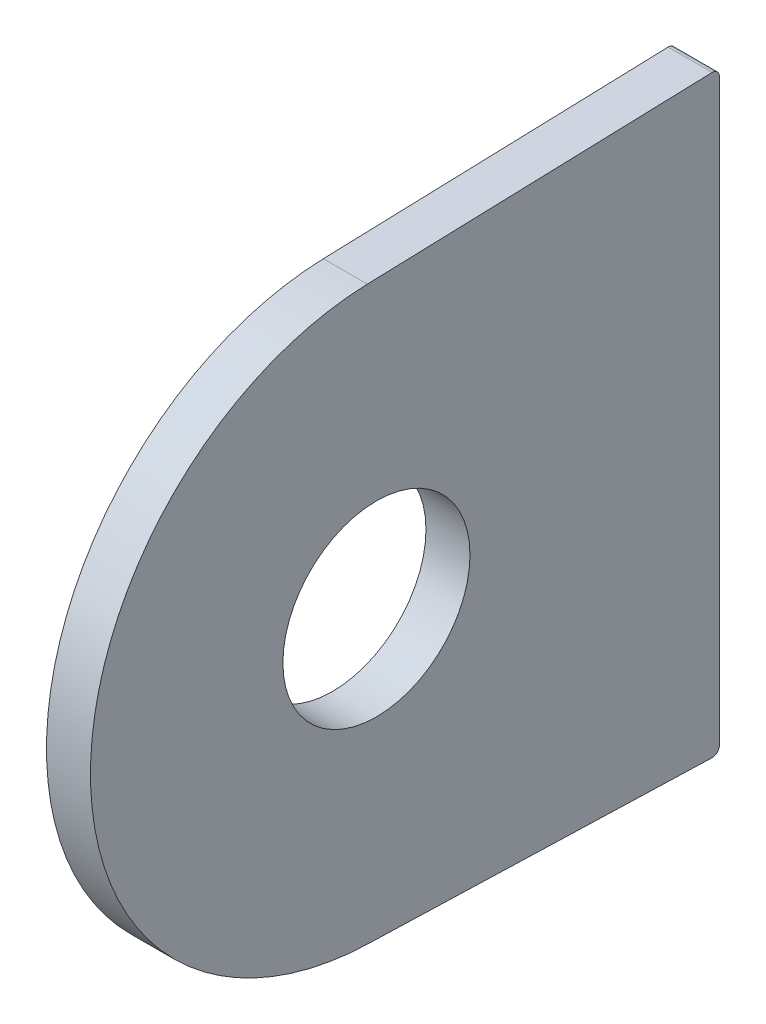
ISO-10303-21;
HEADER;
FILE_DESCRIPTION(('STEP AP214'),'2;1');
FILE_NAME('part.step','',(''),(''),'','','');
FILE_SCHEMA(('AUTOMOTIVE_DESIGN { 1 0 10303 214 1 1 1 1 }'));
ENDSEC;
DATA;
#1=APPLICATION_CONTEXT('core data for automotive mechanical design processes');
#2=APPLICATION_PROTOCOL_DEFINITION('international standard','automotive_design',2000,#1);
#3=PRODUCT_CONTEXT('',#1,'mechanical');
#4=PRODUCT('Part','Part','',(#3));
#5=PRODUCT_RELATED_PRODUCT_CATEGORY('part','',(#4));
#6=PRODUCT_DEFINITION_FORMATION('','',#4);
#7=PRODUCT_DEFINITION_CONTEXT('part definition',#1,'design');
#8=PRODUCT_DEFINITION('design','',#6,#7);
#9=PRODUCT_DEFINITION_SHAPE('','',#8);
#10=(LENGTH_UNIT() NAMED_UNIT(*) SI_UNIT(.MILLI.,.METRE.));
#11=(NAMED_UNIT(*) PLANE_ANGLE_UNIT() SI_UNIT($,.RADIAN.));
#12=(NAMED_UNIT(*) SI_UNIT($,.STERADIAN.) SOLID_ANGLE_UNIT());
#13=UNCERTAINTY_MEASURE_WITH_UNIT(LENGTH_MEASURE(1.E-05),#10,'distance_accuracy_value','');
#14=(GEOMETRIC_REPRESENTATION_CONTEXT(3) GLOBAL_UNCERTAINTY_ASSIGNED_CONTEXT((#13)) GLOBAL_UNIT_ASSIGNED_CONTEXT((#10,
#11,#12)) REPRESENTATION_CONTEXT('',''));
#15=CARTESIAN_POINT('',(0.,0.,0.));
#16=DIRECTION('',(0.,0.,1.));
#17=DIRECTION('',(1.,0.,0.));
#18=AXIS2_PLACEMENT_3D('',#15,#16,#17);
#19=CARTESIAN_POINT('',(1.5875,-20.627166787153,0.652990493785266));
#20=DIRECTION('',(0.,-0.999499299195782,0.0316409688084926));
#21=DIRECTION('',(0.,-0.0316409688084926,-0.999499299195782));
#22=AXIS2_PLACEMENT_3D('',#19,#20,#21);
#23=PLANE('',#22);
#24=DIRECTION('',(0.,0.0316409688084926,0.999499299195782));
#25=VECTOR('',#24,1.);
#26=CARTESIAN_POINT('',(-1.5875,-20.627166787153,0.652990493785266));
#27=LINE('',#26,#25);
#28=CARTESIAN_POINT('',(-1.5875,-21.4146594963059,-24.22293589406));
#29=VERTEX_POINT('',#28);
#30=CARTESIAN_POINT('',(-1.5875,-20.627166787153,0.652990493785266));
#31=VERTEX_POINT('',#30);
#32=EDGE_CURVE('E125',#29,#31,#27,.T.);
#33=ORIENTED_EDGE('',*,*,#32,.F.);
#34=DIRECTION('',(-1.,0.,0.));
#35=VECTOR('',#34,1.);
#36=CARTESIAN_POINT('',(1.5875,-21.4146594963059,-24.22293589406));
#37=LINE('',#36,#35);
#38=CARTESIAN_POINT('',(1.5875,-21.4146594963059,-24.22293589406));
#39=VERTEX_POINT('',#38);
#40=EDGE_CURVE('E138',#29,#39,#37,.F.);
#41=ORIENTED_EDGE('',*,*,#40,.T.);
#42=DIRECTION('',(0.,0.0316409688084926,0.999499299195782));
#43=VECTOR('',#42,1.);
#44=CARTESIAN_POINT('',(1.5875,-20.627166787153,0.652990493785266));
#45=LINE('',#44,#43);
#46=CARTESIAN_POINT('',(1.5875,-20.627166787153,0.652990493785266));
#47=VERTEX_POINT('',#46);
#48=EDGE_CURVE('E132',#39,#47,#45,.T.);
#49=ORIENTED_EDGE('',*,*,#48,.T.);
#50=DIRECTION('',(-1.,0.,0.));
#51=VECTOR('',#50,1.);
#52=CARTESIAN_POINT('',(1.5875,-20.627166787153,0.652990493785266));
#53=LINE('',#52,#51);
#54=EDGE_CURVE('E117',#47,#31,#53,.T.);
#55=ORIENTED_EDGE('',*,*,#54,.T.);
#56=EDGE_LOOP('',(#33,#41,#49,#55));
#57=FACE_BOUND('',#56,.T.);
#58=ADVANCED_FACE('F43',(#57),#23,.T.);
#59=CARTESIAN_POINT('',(1.5875,0.,-24.7470095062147));
#60=DIRECTION('',(0.,0.,1.));
#61=DIRECTION('',(1.,0.,0.));
#62=AXIS2_PLACEMENT_3D('',#59,#60,#61);
#63=PLANE('',#62);
#64=DIRECTION('',(0.,1.,0.));
#65=VECTOR('',#64,1.);
#66=CARTESIAN_POINT('',(-1.5875,0.,-24.7470095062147));
#67=LINE('',#66,#65);
#68=CARTESIAN_POINT('',(-1.5875,-20.9069138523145,-24.7470095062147));
#69=VERTEX_POINT('',#68);
#70=CARTESIAN_POINT('',(-1.5875,20.9069138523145,-24.7470095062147));
#71=VERTEX_POINT('',#70);
#72=EDGE_CURVE('E127',#69,#71,#67,.T.);
#73=ORIENTED_EDGE('',*,*,#72,.T.);
#74=DIRECTION('',(-1.,0.,0.));
#75=VECTOR('',#74,1.);
#76=CARTESIAN_POINT('',(1.5875,20.9069138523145,-24.7470095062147));
#77=LINE('',#76,#75);
#78=CARTESIAN_POINT('',(1.5875,20.9069138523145,-24.7470095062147));
#79=VERTEX_POINT('',#78);
#80=EDGE_CURVE('E51',#71,#79,#77,.F.);
#81=ORIENTED_EDGE('',*,*,#80,.T.);
#82=DIRECTION('',(0.,1.,0.));
#83=VECTOR('',#82,1.);
#84=CARTESIAN_POINT('',(1.5875,0.,-24.7470095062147));
#85=LINE('',#84,#83);
#86=CARTESIAN_POINT('',(1.5875,-20.9069138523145,-24.7470095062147));
#87=VERTEX_POINT('',#86);
#88=EDGE_CURVE('E107',#87,#79,#85,.T.);
#89=ORIENTED_EDGE('',*,*,#88,.F.);
#90=DIRECTION('',(-1.,0.,0.));
#91=VECTOR('',#90,1.);
#92=CARTESIAN_POINT('',(-1.5875,-20.9069138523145,-24.7470095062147));
#93=LINE('',#92,#91);
#94=EDGE_CURVE('E116',#87,#69,#93,.T.);
#95=ORIENTED_EDGE('',*,*,#94,.T.);
#96=EDGE_LOOP('',(#73,#81,#89,#95));
#97=FACE_BOUND('',#96,.T.);
#98=ADVANCED_FACE('F173',(#97),#63,.F.);
#99=CARTESIAN_POINT('',(1.5875,20.627166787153,0.652990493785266));
#100=DIRECTION('',(0.,-0.999499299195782,-0.0316409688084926));
#101=DIRECTION('',(0.,0.0316409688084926,-0.999499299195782));
#102=AXIS2_PLACEMENT_3D('',#99,#100,#101);
#103=PLANE('',#102);
#104=DIRECTION('',(0.,-0.0316409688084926,0.999499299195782));
#105=VECTOR('',#104,1.);
#106=CARTESIAN_POINT('',(1.5875,20.627166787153,0.652990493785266));
#107=LINE('',#106,#105);
#108=CARTESIAN_POINT('',(1.5875,21.4146594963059,-24.22293589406));
#109=VERTEX_POINT('',#108);
#110=CARTESIAN_POINT('',(1.5875,20.627166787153,0.652990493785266));
#111=VERTEX_POINT('',#110);
#112=EDGE_CURVE('E96',#109,#111,#107,.T.);
#113=ORIENTED_EDGE('',*,*,#112,.F.);
#114=DIRECTION('',(-1.,0.,0.));
#115=VECTOR('',#114,1.);
#116=CARTESIAN_POINT('',(1.5875,21.4146594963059,-24.22293589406));
#117=LINE('',#116,#115);
#118=CARTESIAN_POINT('',(-1.5875,21.4146594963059,-24.22293589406));
#119=VERTEX_POINT('',#118);
#120=EDGE_CURVE('E142',#109,#119,#117,.T.);
#121=ORIENTED_EDGE('',*,*,#120,.T.);
#122=DIRECTION('',(0.,-0.0316409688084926,0.999499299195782));
#123=VECTOR('',#122,1.);
#124=CARTESIAN_POINT('',(-1.5875,20.627166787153,0.652990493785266));
#125=LINE('',#124,#123);
#126=CARTESIAN_POINT('',(-1.5875,20.627166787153,0.652990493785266));
#127=VERTEX_POINT('',#126);
#128=EDGE_CURVE('E112',#119,#127,#125,.T.);
#129=ORIENTED_EDGE('',*,*,#128,.T.);
#130=DIRECTION('',(-1.,0.,0.));
#131=VECTOR('',#130,1.);
#132=CARTESIAN_POINT('',(1.5875,20.627166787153,0.652990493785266));
#133=LINE('',#132,#131);
#134=EDGE_CURVE('E110',#111,#127,#133,.T.);
#135=ORIENTED_EDGE('',*,*,#134,.F.);
#136=EDGE_LOOP('',(#113,#121,#129,#135));
#137=FACE_BOUND('',#136,.T.);
#138=ADVANCED_FACE('F111',(#137),#103,.F.);
#139=CARTESIAN_POINT('',(1.5875,0.,0.));
#140=DIRECTION('',(-1.,0.,0.));
#141=DIRECTION('',(0.,0.,1.));
#142=AXIS2_PLACEMENT_3D('',#139,#140,#141);
#143=CYLINDRICAL_SURFACE('',#142,20.6375);
#144=CARTESIAN_POINT('',(-1.5875,0.,0.));
#145=DIRECTION('',(1.,0.,0.));
#146=DIRECTION('',(0.,0.,-1.));
#147=AXIS2_PLACEMENT_3D('',#144,#145,#146);
#148=CIRCLE('',#147,20.6375);
#149=EDGE_CURVE('E131',#127,#31,#148,.T.);
#150=ORIENTED_EDGE('',*,*,#149,.T.);
#151=ORIENTED_EDGE('',*,*,#54,.F.);
#152=CARTESIAN_POINT('',(1.5875,0.,0.));
#153=DIRECTION('',(1.,0.,0.));
#154=DIRECTION('',(0.,0.,-1.));
#155=AXIS2_PLACEMENT_3D('',#152,#153,#154);
#156=CIRCLE('',#155,20.6375);
#157=EDGE_CURVE('E101',#111,#47,#156,.T.);
#158=ORIENTED_EDGE('',*,*,#157,.F.);
#159=ORIENTED_EDGE('',*,*,#134,.T.);
#160=EDGE_LOOP('',(#150,#151,#158,#159));
#161=FACE_BOUND('',#160,.T.);
#162=ADVANCED_FACE('F119',(#161),#143,.T.);
#163=CARTESIAN_POINT('',(1.5875,0.,0.));
#164=DIRECTION('',(1.,0.,0.));
#165=DIRECTION('',(0.,0.,-1.));
#166=AXIS2_PLACEMENT_3D('',#163,#164,#165);
#167=PLANE('',#166);
#168=CARTESIAN_POINT('',(1.5875,0.,0.));
#169=DIRECTION('',(-1.,0.,0.));
#170=DIRECTION('',(0.,0.,1.));
#171=AXIS2_PLACEMENT_3D('',#168,#169,#170);
#172=CIRCLE('',#171,6.75);
#173=CARTESIAN_POINT('',(1.5875,0.,6.75));
#174=VERTEX_POINT('',#173);
#175=EDGE_CURVE('E128',#174,#174,#172,.T.);
#176=ORIENTED_EDGE('',*,*,#175,.T.);
#177=EDGE_LOOP('',(#176));
#178=FACE_BOUND('',#177,.T.);
#179=ORIENTED_EDGE('',*,*,#88,.T.);
#180=CARTESIAN_POINT('',(1.5875,20.9069138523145,-24.2390095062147));
#181=DIRECTION('',(1.,0.,0.));
#182=DIRECTION('',(0.,0.,-1.));
#183=AXIS2_PLACEMENT_3D('',#180,#181,#182);
#184=CIRCLE('',#183,0.508);
#185=EDGE_CURVE('E11',#79,#109,#184,.T.);
#186=ORIENTED_EDGE('',*,*,#185,.T.);
#187=ORIENTED_EDGE('',*,*,#112,.T.);
#188=ORIENTED_EDGE('',*,*,#157,.T.);
#189=ORIENTED_EDGE('',*,*,#48,.F.);
#190=CARTESIAN_POINT('',(1.5875,-20.9069138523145,-24.2390095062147));
#191=DIRECTION('',(1.,0.,0.));
#192=DIRECTION('',(0.,0.,-1.));
#193=AXIS2_PLACEMENT_3D('',#190,#191,#192);
#194=CIRCLE('',#193,0.508);
#195=EDGE_CURVE('E140',#39,#87,#194,.T.);
#196=ORIENTED_EDGE('',*,*,#195,.T.);
#197=EDGE_LOOP('',(#179,#186,#187,#188,#189,#196));
#198=FACE_BOUND('',#197,.T.);
#199=ADVANCED_FACE('F98',(#178,#198),#167,.T.);
#200=CARTESIAN_POINT('',(-1.5875,0.,0.));
#201=DIRECTION('',(1.,0.,0.));
#202=DIRECTION('',(0.,0.,-1.));
#203=AXIS2_PLACEMENT_3D('',#200,#201,#202);
#204=PLANE('',#203);
#205=CARTESIAN_POINT('',(-1.5875,0.,0.));
#206=DIRECTION('',(-1.,0.,0.));
#207=DIRECTION('',(0.,0.,1.));
#208=AXIS2_PLACEMENT_3D('',#205,#206,#207);
#209=CIRCLE('',#208,6.75);
#210=CARTESIAN_POINT('',(-1.5875,0.,6.75));
#211=VERTEX_POINT('',#210);
#212=EDGE_CURVE('E154',#211,#211,#209,.T.);
#213=ORIENTED_EDGE('',*,*,#212,.F.);
#214=EDGE_LOOP('',(#213));
#215=FACE_BOUND('',#214,.T.);
#216=ORIENTED_EDGE('',*,*,#128,.F.);
#217=CARTESIAN_POINT('',(-1.5875,20.9069138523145,-24.2390095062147));
#218=DIRECTION('',(1.,0.,0.));
#219=DIRECTION('',(0.,0.,-1.));
#220=AXIS2_PLACEMENT_3D('',#217,#218,#219);
#221=CIRCLE('',#220,0.508);
#222=EDGE_CURVE('E65',#119,#71,#221,.F.);
#223=ORIENTED_EDGE('',*,*,#222,.T.);
#224=ORIENTED_EDGE('',*,*,#72,.F.);
#225=CARTESIAN_POINT('',(-1.5875,-20.9069138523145,-24.2390095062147));
#226=DIRECTION('',(1.,0.,0.));
#227=DIRECTION('',(0.,0.,-1.));
#228=AXIS2_PLACEMENT_3D('',#225,#226,#227);
#229=CIRCLE('',#228,0.508);
#230=EDGE_CURVE('E136',#69,#29,#229,.F.);
#231=ORIENTED_EDGE('',*,*,#230,.T.);
#232=ORIENTED_EDGE('',*,*,#32,.T.);
#233=ORIENTED_EDGE('',*,*,#149,.F.);
#234=EDGE_LOOP('',(#216,#223,#224,#231,#232,#233));
#235=FACE_BOUND('',#234,.T.);
#236=ADVANCED_FACE('F145',(#215,#235),#204,.F.);
#237=CARTESIAN_POINT('',(1.5875,-20.9069138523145,-24.2390095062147));
#238=DIRECTION('',(1.,0.,0.));
#239=DIRECTION('',(0.,0.,-1.));
#240=AXIS2_PLACEMENT_3D('',#237,#238,#239);
#241=CYLINDRICAL_SURFACE('',#240,0.508);
#242=ORIENTED_EDGE('',*,*,#195,.F.);
#243=ORIENTED_EDGE('',*,*,#40,.F.);
#244=ORIENTED_EDGE('',*,*,#230,.F.);
#245=ORIENTED_EDGE('',*,*,#94,.F.);
#246=EDGE_LOOP('',(#242,#243,#244,#245));
#247=FACE_BOUND('',#246,.T.);
#248=ADVANCED_FACE('F161',(#247),#241,.T.);
#249=CARTESIAN_POINT('',(1.5875,20.9069138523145,-24.2390095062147));
#250=DIRECTION('',(-1.,0.,0.));
#251=DIRECTION('',(0.,0.,1.));
#252=AXIS2_PLACEMENT_3D('',#249,#250,#251);
#253=CYLINDRICAL_SURFACE('',#252,0.508);
#254=ORIENTED_EDGE('',*,*,#185,.F.);
#255=ORIENTED_EDGE('',*,*,#80,.F.);
#256=ORIENTED_EDGE('',*,*,#222,.F.);
#257=ORIENTED_EDGE('',*,*,#120,.F.);
#258=EDGE_LOOP('',(#254,#255,#256,#257));
#259=FACE_BOUND('',#258,.T.);
#260=ADVANCED_FACE('F45',(#259),#253,.T.);
#261=CARTESIAN_POINT('',(-1.5875,0.,0.));
#262=DIRECTION('',(-1.,0.,0.));
#263=DIRECTION('',(0.,0.,1.));
#264=AXIS2_PLACEMENT_3D('',#261,#262,#263);
#265=CYLINDRICAL_SURFACE('',#264,6.75);
#266=ORIENTED_EDGE('',*,*,#175,.F.);
#267=EDGE_LOOP('',(#266));
#268=FACE_BOUND('',#267,.T.);
#269=ORIENTED_EDGE('',*,*,#212,.T.);
#270=EDGE_LOOP('',(#269));
#271=FACE_BOUND('',#270,.T.);
#272=ADVANCED_FACE('F158',(#268,#271),#265,.F.);
#273=CLOSED_SHELL('',(#58,#98,#138,#162,#199,#236,#248,#260,#272));
#274=MANIFOLD_SOLID_BREP('B2',#273);
#275=ADVANCED_BREP_SHAPE_REPRESENTATION('',(#18,#274),#14);
#276=SHAPE_DEFINITION_REPRESENTATION(#9,#275);
ENDSEC;
END-ISO-10303-21;
